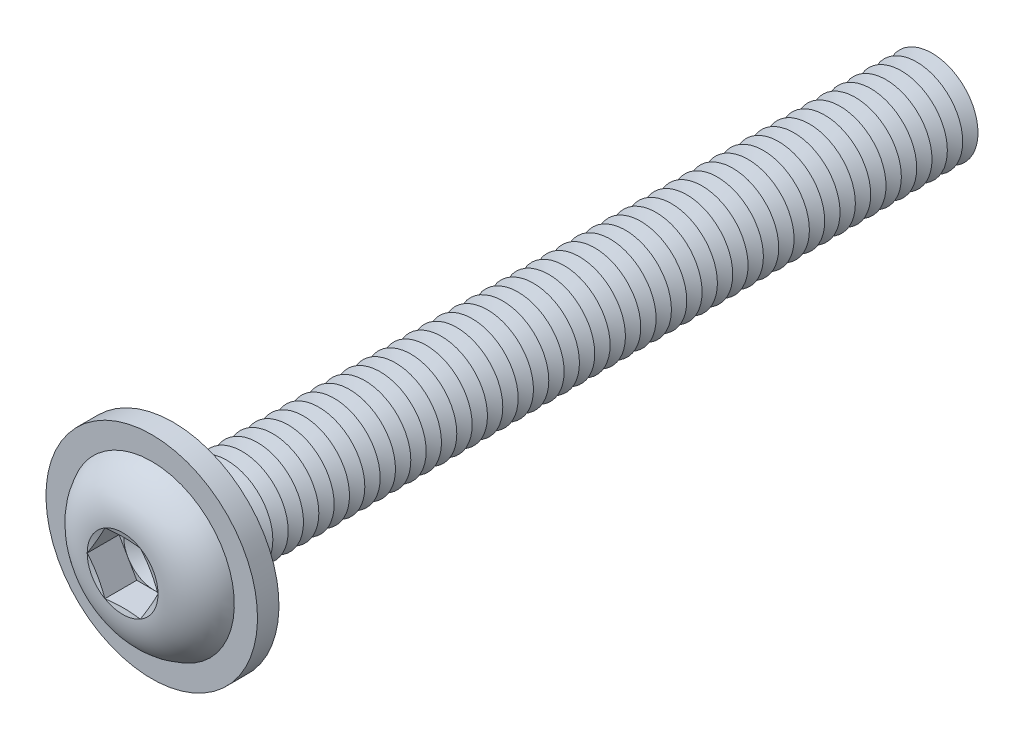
from build123d import *

# Parameters (mm, degrees)
FILLET1_R           = 0.25
LPATTERN1_COUNT     = 50
LPATTERN1_PITCH     = 0.5
CUT_EXTRUDE1_DEPTH  = 1.04
SKETCH5_R           = 3.45
SKETCH5_R_2         = 1.75
BOSS_EXTRUDE1_DEPTH = 0.7


with BuildPart() as part:
    # Sketch1 → Revolve1 (revolve)
    with BuildSketch(Plane(origin=(0, 0, 0), x_dir=(0, 0, -1), z_dir=(1, 0, 0)), mode=Mode.PRIVATE) as revolve1_sk:
        with BuildLine():
            Line((0, 1.5), (0, 2.85))
            ThreePointArc((0, 2.85), (-1.182850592, 2.35063849), (-1.65, 1.1547))
            Line((-1.65, 1.1547), (-1.495299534, 0.57735))
            Line((-1.495299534, 0.57735), (-1.65, 0.57735))
            Line((-1.65, 0.57735), (-1.65, 0))
            Line((-1.65, 0), (25, 0))
            Line((25, 0), (25, 1.5))
            Line((25, 1.5), (0, 1.5))
        make_face()
    revolve(revolve1_sk.sketch.rotate(Axis((0, 0, -25), (0, 0, 1)), 90), axis=Axis((0, 0, -25), (0, 0, 1)))

    # Fillet1
    fillet1_edges = [part.edges().sort_by_distance(p)[0] for p in [
        (1.5, 0, 0),
    ]]
    fillet(fillet1_edges, radius=FILLET1_R)

    # Sketch2 → Cut-Revolve1 (revolve, cut)
    with BuildSketch(Plane(origin=(0, 0, 0), x_dir=(0, 0, -1), z_dir=(1, 0, 0)), mode=Mode.PRIVATE) as cut_revolve1_sk:
        Polygon((24.75, 1.5), (25.25, 1.5), (25, 1.066987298), align=None)
    cut_revolve1 = revolve(cut_revolve1_sk.sketch.rotate(Axis((0, 0, -25), (0, 0, -1)), 270), axis=Axis((0, 0, -25), (0, 0, -1)), mode=Mode.SUBTRACT)

    # LPattern1: Cut-Revolve1 ×50
    with Locations(*[(0, 0, i * LPATTERN1_PITCH) for i in range(1, LPATTERN1_COUNT)]):
        add(cut_revolve1, mode=Mode.SUBTRACT)

    # Sketch3 → Cut-Extrude1 (cut)
    with BuildSketch(Plane.XY.offset(1.65)):
        Polygon((0.57735, 0.999999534), (-0.57735, 0.999999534), (-1.1547, 0), (-0.57735, -0.999999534), (0.57735, -0.999999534), (1.1547, 0), align=None)
    extrude(amount=-CUT_EXTRUDE1_DEPTH, mode=Mode.SUBTRACT)

    # Cut-Extrude2 cone 1 section (on through the dimple's axis) → Cut-Extrude2 (revolve, cut)
    with BuildSketch(Plane(origin=(0, 0, 0.61), x_dir=(0, -1, 0), z_dir=(1, 0, 0))):
        Polygon((0, 0), (0.999999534, 0), (0, 0.57735), align=None)
    revolve(axis=Axis((0, 0, 0.61), (0, 0, -1)), mode=Mode.SUBTRACT)

    # Sketch5 → Boss-Extrude1 (add)
    with BuildSketch(Plane(origin=(0, 0, 0), x_dir=(-1, 0, 0), z_dir=(0, 0, -1))):
        with Locations(Location((0, 0, 0), (0, 0, 90))):
            Circle(SKETCH5_R)
        Circle(SKETCH5_R_2, mode=Mode.SUBTRACT)
    extrude(amount=-BOSS_EXTRUDE1_DEPTH)


solid = part.part
